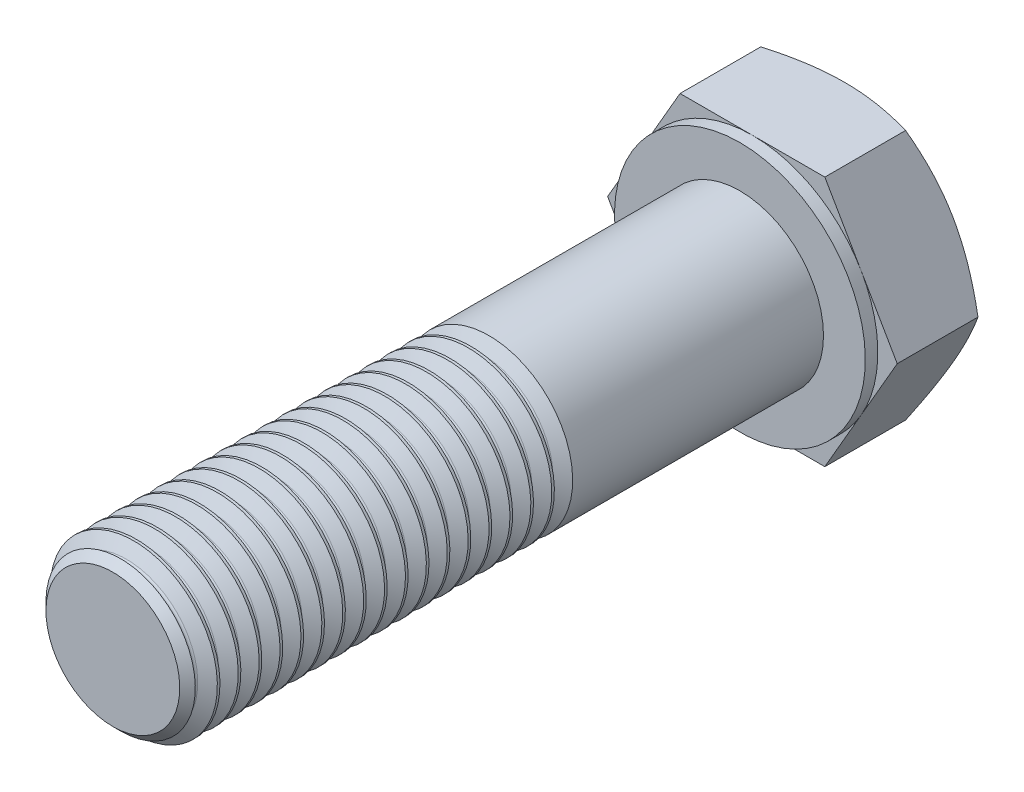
from build123d import *

# Parameters (mm, degrees)
SKETCH5_W               = 90
SKETCH5_H               = 12
THREAD_SIMPLE_COUNT     = 18
THREAD_SIMPLE_PITCH     = 3
SKETCH15_W              = 15
SKETCH15_H              = 24
SKETCH19_W              = 1.8
SKETCH19_H              = 6
SKETCH21_OUTSIDE_W      = 75.006
SKETCH21_OUTSIDE_H      = 75.006
CUT_PROFILE_OUTER_DEPTH = 97.187317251


with BuildPart() as part:
    # Sketch5 → body (revolve)
    with BuildSketch(Plane(origin=(0, 0, 0), x_dir=(0, 0, -1), z_dir=(1, 0, 0)), mode=Mode.PRIVATE) as body_sk:
        with Locations((45, 6)):
            Rectangle(SKETCH5_W, SKETCH5_H)
    revolve(body_sk.sketch.rotate(Axis((0, 0, 0), (0, 0, -1)), 180), axis=Axis((0, 0, 0), (0, 0, -1)))

    # Sketch11 → cut-chamfer-start (revolve, cut)
    with BuildSketch(Plane(origin=(0, 0, 0), x_dir=(0, 0, -1), z_dir=(1, 0, 0))):
        Polygon((0, -12), (0, -9.6), (2.4, -12), align=None)
    revolve(axis=Axis((0, 0, 0), (0, 0, -1)), mode=Mode.SUBTRACT)

    # Sketch8 → thread-single (revolve, cut)
    with BuildSketch(Plane(origin=(0, 0, 0), x_dir=(0, 0, -1), z_dir=(1, 0, 0))):
        with BuildLine():
            Line((51.375, -12), (54, -12))
            Line((54, -12), (52.96875, -10.213822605))
            ThreePointArc((52.96875, -10.213822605), (52.6875, -10.051442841), (52.40625, -10.213822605))
            Line((52.40625, -10.213822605), (51.375, -12))
        make_face()
    thread_single = revolve(axis=Axis((0, 0, 0), (0, 0, -1)), mode=Mode.SUBTRACT)

    # thread-simple: thread-single ×18
    with Locations(*[(0, 0, i * THREAD_SIMPLE_PITCH) for i in range(1, THREAD_SIMPLE_COUNT)]):
        add(thread_single, mode=Mode.SUBTRACT)

    # Sketch15 → body-head (revolve)
    with BuildSketch(Plane(origin=(0, 0, 0), x_dir=(0, 0, -1), z_dir=(1, 0, 0)), mode=Mode.PRIVATE) as body_head_sk:
        with Locations((97.5, -12)):
            Rectangle(SKETCH15_W, SKETCH15_H)
    revolve(body_head_sk.sketch.rotate(Axis((0, 0, -105), (0, 0, 1)), 180), axis=Axis((0, 0, -105), (0, 0, 1)))

    # Sketch19 → cut-head-profile (revolve, cut)
    with BuildSketch(Plane(origin=(0, 0, 0), x_dir=(0, 0, -1), z_dir=(1, 0, 0)), mode=Mode.PRIVATE) as cut_head_profile_sk:
        with Locations((90.9, -21)):
            Rectangle(SKETCH19_W, SKETCH19_H)
        Polygon((105, -24), (105, -18), (101.535898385, -24), align=None)
    revolve(cut_head_profile_sk.sketch.rotate(Axis((0, 0, -105), (0, 0, 1)), 180), axis=Axis((0, 0, -105), (0, 0, 1)), mode=Mode.SUBTRACT)

    # Sketch21 outside → cut-profile-outer (cut, through all)
    with BuildSketch(Plane.XY.offset(-90)):
        Rectangle(SKETCH21_OUTSIDE_W, SKETCH21_OUTSIDE_H)
        Polygon((20.784609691, 0), (10.392304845, 18), (-10.392304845, 18), (-20.784609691, 0), (-10.392304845, -18), (10.392304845, -18), align=None, mode=Mode.SUBTRACT)
    extrude(amount=-CUT_PROFILE_OUTER_DEPTH, mode=Mode.SUBTRACT)


solid = part.part
